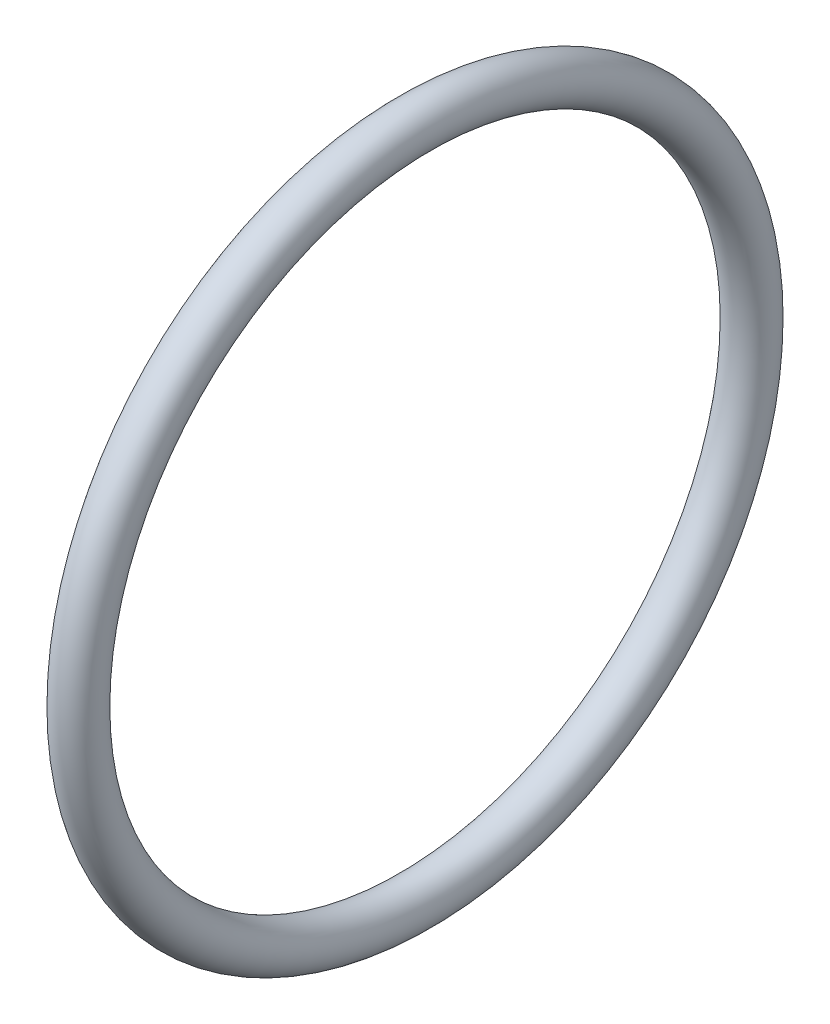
from build123d import *

# Parameters (mm, degrees)
SKETCH1_R = 0.889


with BuildPart() as part:
    # Sketch1 → Base-Revolve (revolve)
    with BuildSketch(Plane.XY, mode=Mode.PRIVATE) as base_revolve_sk:
        with Locations((0, 13.4493)):
            Circle(SKETCH1_R)
    revolve(base_revolve_sk.sketch.rotate(Axis((0, 0, 0), (1, 0, 0)), 90), axis=Axis((0, 0, 0), (1, 0, 0)))


solid = part.part
